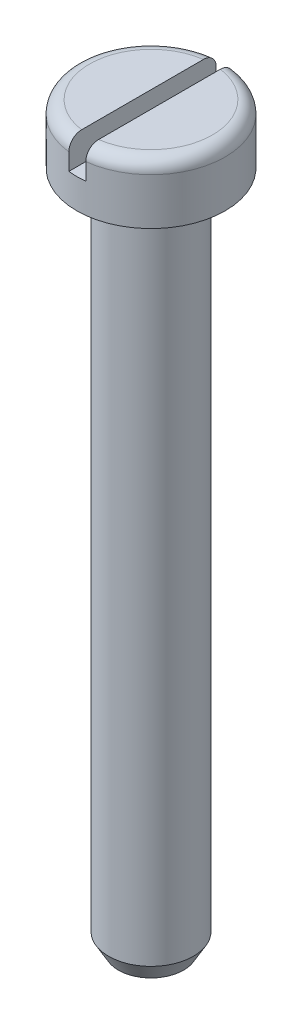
from build123d import *

# Parameters (mm, degrees)
ESQUISSE2_R             = 1.75
BOSS_EXTRU_1_DEPTH      = 1.4
ESQUISSE3_W             = 0.4
ESQUISSE3_H             = 4
ENL_V_MAT_EXTRU_1_DEPTH = 0.7
ESQUISSE4_R             = 1
BOSS_EXTRU_2_DEPTH      = 16
CHANFREIN1_SIZE         = 0.4
CHANFREIN1_SIZE2        = 0.230940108
CONG_1_R                = 0.3


with BuildPart() as part:
    # Esquisse2 → Boss.-Extru.1 (new body)
    with BuildSketch(Plane(origin=(0, 0, 0), x_dir=(1, 0, 0), z_dir=(0, 1, 0))):
        with Locations(Location((0, 0, 0), (0, 0, 270))):
            Circle(ESQUISSE2_R)
    extrude(amount=BOSS_EXTRU_1_DEPTH)

    # Esquisse3 → Enl_v. mat.-Extru.1 (cut)
    with BuildSketch(Plane(origin=(0, 1.4, 0), x_dir=(1, 0, 0), z_dir=(0, 1, 0))):
        Rectangle(ESQUISSE3_W, ESQUISSE3_H)
    extrude(amount=-ENL_V_MAT_EXTRU_1_DEPTH, mode=Mode.SUBTRACT)

    # Esquisse4 → Boss.-Extru.2 (add)
    with BuildSketch(Plane.XZ):
        with Locations(Location((0, 0, 0), (0, 0, 270))):
            Circle(ESQUISSE4_R)
    extrude(amount=BOSS_EXTRU_2_DEPTH)

    # Chanfrein1
    chanfrein1_edges = [part.edges().sort_by_distance(p)[0] for p in [
        (0, -16, 1),
    ]]
    chanfrein1_side = [part.faces().sort_by_distance(p)[0] for p in [
        (0, -8, 1),
    ]]
    chamfer(chanfrein1_edges, length=CHANFREIN1_SIZE, length2=CHANFREIN1_SIZE2, reference=chanfrein1_side[0])

    # Cong_1
    cong_1_edges = [part.edges().sort_by_distance(p)[0] for p in [
        (1.75, 1.4, 0),
        (-1.75, 1.4, 0),
    ]]
    fillet(cong_1_edges, radius=CONG_1_R)


solid = part.part
